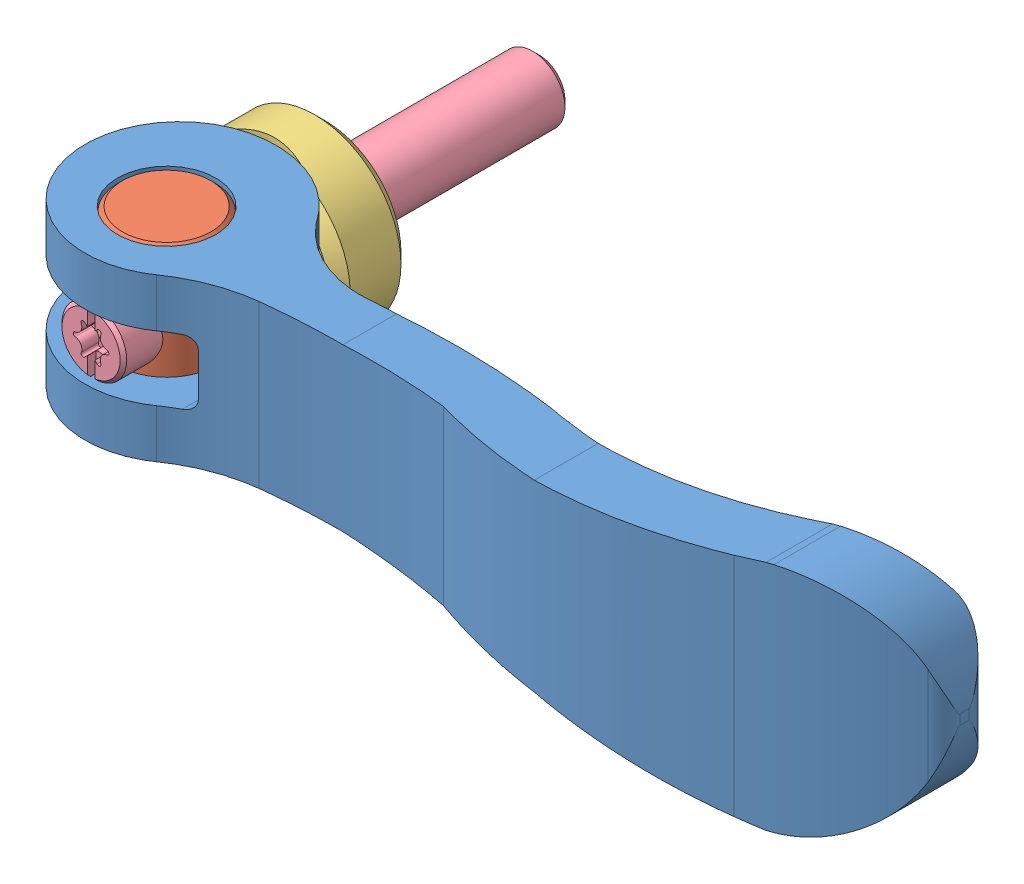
SolidWorks assembly KCL06X20-RE.SLDASM, configuration Default (file format 15000). Lengths in mm.
Overall size (79.19 21.52 42.07).
4 component instances, 4 part files, 0 mates.
Components (placement in the parent):
- KCL06X20-RE_01-1: KCL06X20-RE_01.SLDPRT [ﾃﾞﾌｫﾙﾄ] at (0 0 14.7) x (1 0 0) z (0 -1 0) size (79.19 17.58 21.52)
- KCL06X20-RE_02-1: KCL06X20-RE_02.SLDPRT [ﾃﾞﾌｫﾙﾄ] at (0 0 14.7) x (0 1 0) z (1 0 0) size (15 9 9)
- KCL06X20-RE_03-1: KCL06X20-RE_03.SLDPRT [ﾃﾞﾌｫﾙﾄ] x (1 0 0) z (0 -1 0) size (16 7.24 16)
- KCL06X20-RE_04-1: KCL06X20-RE_04.SLDPRT [ﾃﾞﾌｫﾙﾄ] at (0 0 -19.8) x (0 1 0) z (1 0 0) size (6 41.5 6)
